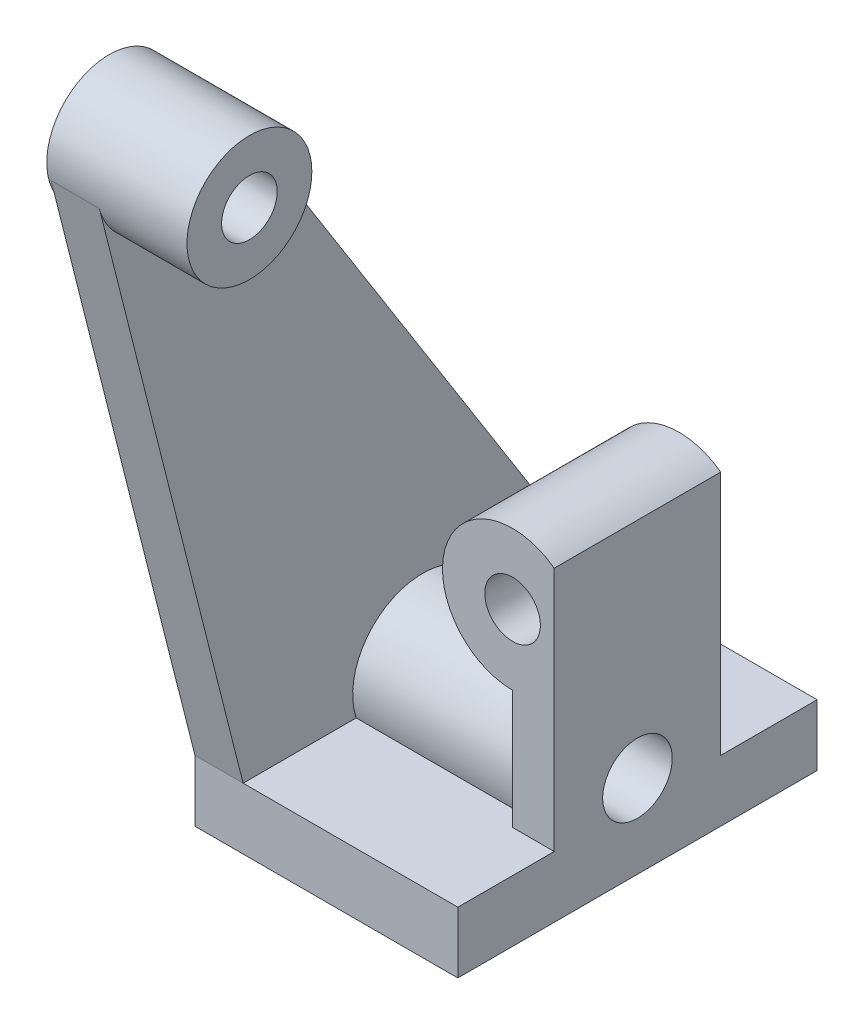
from build123d import *

# Parameters (mm, degrees)
SKETCH1_W      = 120
SKETCH1_H      = 164
EXTRUDE1_DEPTH = 28
SKETCH3_R      = 12.7
EXTRUDE2_DEPTH = 38
EXTRUDE3_START = -57.12
SKETCH2_R      = 28.5
SKETCH2_R_2    = 12.7
EXTRUDE3_DEPTH = 64
EXTRUDE4_DEPTH = 22
SKETCH5_R      = 32
EXTRUDE5_DEPTH = 98
SKETCH6_R      = 15.875
EXTRUDE6_DEPTH = 376.998077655


with BuildPart() as part:
    # Sketch1 → Extrude1 (new body)
    with BuildSketch(Plane(origin=(0, 0, 0), x_dir=(1, 0, 0), z_dir=(0, 1, 0))):
        Rectangle(SKETCH1_W, SKETCH1_H)
    extrude(amount=EXTRUDE1_DEPTH)

    # Sketch3 → Extrude2 (add, symmetric)
    with BuildSketch(Plane.XY):
        with BuildLine():
            Line((60, 0), (60, 139.998786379))
            ThreePointArc((60, 139.998786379), (10.602951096, 124.25097085), (41, 82.25))
            Line((41, 82.25), (41, 0))
            Line((41, 0), (60, 0))
        make_face()
        with Locations((41, 114.25)):
            Circle(SKETCH3_R, mode=Mode.SUBTRACT)
    extrude(amount=EXTRUDE2_DEPTH, both=True)



with BuildPart() as body_2:
    # Sketch2 → Extrude3 (new body)
    with BuildSketch(Plane(origin=(60, 0, 0), x_dir=(0, 0, -1), z_dir=(1, 0, 0)).offset(EXTRUDE3_START)):
        with Locations((-120, 295)):
            Circle(SKETCH2_R)
        with Locations((-120, 295)):
            Circle(SKETCH2_R_2, mode=Mode.SUBTRACT)
    extrude(amount=-EXTRUDE3_DEPTH)


with BuildPart() as part_1:
    add(part.part)

    add(body_2.part)  # Extrude4 merges body 2
    # Sketch4 → Extrude4 (add)
    with BuildSketch(Plane.ZY.offset(60)):
        with BuildLine():
            Line((82, 28), (147.633310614, 288.025034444))
            ThreePointArc((147.633310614, 288.025034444), (108.774370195, 268.803908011), (95.890465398, 310.198037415))
            Line((95.890465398, 310.198037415), (-82, 28))
            Line((-82, 28), (82, 28))
        make_face()
    extrude(amount=-EXTRUDE4_DEPTH)

    # Sketch5 → Extrude5 (add)
    with BuildSketch(Plane(origin=(60, 0, 0), x_dir=(0, 0, -1), z_dir=(1, 0, 0))):
        with Locations((0, 38)):
            Circle(SKETCH5_R)
    extrude(amount=-EXTRUDE5_DEPTH)

    # Sketch6 → Extrude6 (cut, through all)
    with BuildSketch(Plane(origin=(60, 0, 0), x_dir=(0, 0, -1), z_dir=(1, 0, 0))):
        with Locations((0, 38)):
            Circle(SKETCH6_R)
    extrude(amount=-EXTRUDE6_DEPTH, mode=Mode.SUBTRACT)


solid = part_1.part
